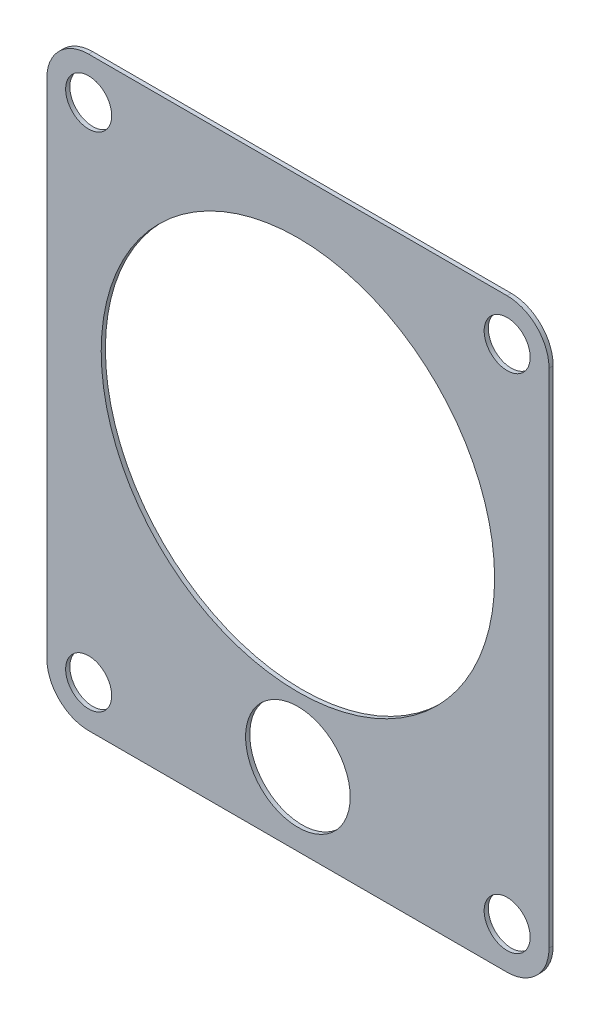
ISO-10303-21;
HEADER;
FILE_DESCRIPTION(('STEP AP214'),'2;1');
FILE_NAME('part.step','',(''),(''),'','','');
FILE_SCHEMA(('AUTOMOTIVE_DESIGN { 1 0 10303 214 1 1 1 1 }'));
ENDSEC;
DATA;
#1=APPLICATION_CONTEXT('core data for automotive mechanical design processes');
#2=APPLICATION_PROTOCOL_DEFINITION('international standard','automotive_design',2000,#1);
#3=PRODUCT_CONTEXT('',#1,'mechanical');
#4=PRODUCT('Part','Part','',(#3));
#5=PRODUCT_RELATED_PRODUCT_CATEGORY('part','',(#4));
#6=PRODUCT_DEFINITION_FORMATION('','',#4);
#7=PRODUCT_DEFINITION_CONTEXT('part definition',#1,'design');
#8=PRODUCT_DEFINITION('design','',#6,#7);
#9=PRODUCT_DEFINITION_SHAPE('','',#8);
#10=(LENGTH_UNIT() NAMED_UNIT(*) SI_UNIT(.MILLI.,.METRE.));
#11=(NAMED_UNIT(*) PLANE_ANGLE_UNIT() SI_UNIT($,.RADIAN.));
#12=(NAMED_UNIT(*) SI_UNIT($,.STERADIAN.) SOLID_ANGLE_UNIT());
#13=UNCERTAINTY_MEASURE_WITH_UNIT(LENGTH_MEASURE(1.E-05),#10,'distance_accuracy_value','');
#14=(GEOMETRIC_REPRESENTATION_CONTEXT(3) GLOBAL_UNCERTAINTY_ASSIGNED_CONTEXT((#13)) GLOBAL_UNIT_ASSIGNED_CONTEXT((#10,
#11,#12)) REPRESENTATION_CONTEXT('',''));
#15=CARTESIAN_POINT('',(0.,0.,0.));
#16=DIRECTION('',(0.,0.,1.));
#17=DIRECTION('',(1.,0.,0.));
#18=AXIS2_PLACEMENT_3D('',#15,#16,#17);
#19=CARTESIAN_POINT('',(10.,130.,1.));
#20=DIRECTION('',(0.,0.,1.));
#21=DIRECTION('',(1.,0.,0.));
#22=AXIS2_PLACEMENT_3D('',#19,#20,#21);
#23=PLANE('',#22);
#24=CARTESIAN_POINT('',(10.,10.,1.));
#25=DIRECTION('',(0.,0.,1.));
#26=DIRECTION('',(1.,0.,0.));
#27=AXIS2_PLACEMENT_3D('',#24,#25,#26);
#28=CIRCLE('',#27,5.5);
#29=CARTESIAN_POINT('',(15.5,10.,1.));
#30=VERTEX_POINT('',#29);
#31=EDGE_CURVE('E234',#30,#30,#28,.T.);
#32=ORIENTED_EDGE('',*,*,#31,.F.);
#33=EDGE_LOOP('',(#32));
#34=FACE_BOUND('',#33,.T.);
#35=CARTESIAN_POINT('',(10.,130.,1.));
#36=DIRECTION('',(0.,0.,1.));
#37=DIRECTION('',(1.,0.,0.));
#38=AXIS2_PLACEMENT_3D('',#35,#36,#37);
#39=CIRCLE('',#38,5.5);
#40=CARTESIAN_POINT('',(15.5,130.,1.));
#41=VERTEX_POINT('',#40);
#42=EDGE_CURVE('E246',#41,#41,#39,.T.);
#43=ORIENTED_EDGE('',*,*,#42,.F.);
#44=EDGE_LOOP('',(#43));
#45=FACE_BOUND('',#44,.T.);
#46=CARTESIAN_POINT('',(60.,80.,1.));
#47=DIRECTION('',(0.,0.,1.));
#48=DIRECTION('',(1.,0.,0.));
#49=AXIS2_PLACEMENT_3D('',#46,#47,#48);
#50=CIRCLE('',#49,47.);
#51=CARTESIAN_POINT('',(107.,80.,1.));
#52=VERTEX_POINT('',#51);
#53=EDGE_CURVE('E108',#52,#52,#50,.T.);
#54=ORIENTED_EDGE('',*,*,#53,.F.);
#55=EDGE_LOOP('',(#54));
#56=FACE_BOUND('',#55,.T.);
#57=CARTESIAN_POINT('',(10.,130.,1.));
#58=DIRECTION('',(0.,0.,1.));
#59=DIRECTION('',(1.,0.,0.));
#60=AXIS2_PLACEMENT_3D('',#57,#58,#59);
#61=CIRCLE('',#60,10.);
#62=CARTESIAN_POINT('',(10.0000000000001,140.,1.));
#63=VERTEX_POINT('',#62);
#64=CARTESIAN_POINT('',(0.,130.,1.));
#65=VERTEX_POINT('',#64);
#66=EDGE_CURVE('E126',#63,#65,#61,.T.);
#67=ORIENTED_EDGE('',*,*,#66,.T.);
#68=DIRECTION('',(0.,-1.,0.));
#69=VECTOR('',#68,1.);
#70=CARTESIAN_POINT('',(0.,10.0000000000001,1.));
#71=LINE('',#70,#69);
#72=CARTESIAN_POINT('',(0.,10.0000000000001,1.));
#73=VERTEX_POINT('',#72);
#74=EDGE_CURVE('E103',#65,#73,#71,.T.);
#75=ORIENTED_EDGE('',*,*,#74,.T.);
#76=CARTESIAN_POINT('',(10.,10.,1.));
#77=DIRECTION('',(0.,0.,1.));
#78=DIRECTION('',(1.,0.,0.));
#79=AXIS2_PLACEMENT_3D('',#76,#77,#78);
#80=CIRCLE('',#79,10.);
#81=CARTESIAN_POINT('',(10.0000000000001,0.,1.));
#82=VERTEX_POINT('',#81);
#83=EDGE_CURVE('E129',#73,#82,#80,.T.);
#84=ORIENTED_EDGE('',*,*,#83,.T.);
#85=DIRECTION('',(1.,0.,0.));
#86=VECTOR('',#85,1.);
#87=CARTESIAN_POINT('',(10.0000000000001,0.,1.));
#88=LINE('',#87,#86);
#89=CARTESIAN_POINT('',(110.,0.,1.));
#90=VERTEX_POINT('',#89);
#91=EDGE_CURVE('E131',#82,#90,#88,.T.);
#92=ORIENTED_EDGE('',*,*,#91,.T.);
#93=CARTESIAN_POINT('',(110.,10.,1.));
#94=DIRECTION('',(0.,0.,1.));
#95=DIRECTION('',(-1.,0.,0.));
#96=AXIS2_PLACEMENT_3D('',#93,#94,#95);
#97=CIRCLE('',#96,10.);
#98=CARTESIAN_POINT('',(120.,10.0000000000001,1.));
#99=VERTEX_POINT('',#98);
#100=EDGE_CURVE('E133',#90,#99,#97,.T.);
#101=ORIENTED_EDGE('',*,*,#100,.T.);
#102=DIRECTION('',(0.,1.,0.));
#103=VECTOR('',#102,1.);
#104=CARTESIAN_POINT('',(120.,10.0000000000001,1.));
#105=LINE('',#104,#103);
#106=CARTESIAN_POINT('',(120.,130.,1.));
#107=VERTEX_POINT('',#106);
#108=EDGE_CURVE('E135',#99,#107,#105,.T.);
#109=ORIENTED_EDGE('',*,*,#108,.T.);
#110=CARTESIAN_POINT('',(110.,130.,1.));
#111=DIRECTION('',(0.,0.,1.));
#112=DIRECTION('',(1.,0.,0.));
#113=AXIS2_PLACEMENT_3D('',#110,#111,#112);
#114=CIRCLE('',#113,10.);
#115=CARTESIAN_POINT('',(110.,140.,1.));
#116=VERTEX_POINT('',#115);
#117=EDGE_CURVE('E44',#107,#116,#114,.T.);
#118=ORIENTED_EDGE('',*,*,#117,.T.);
#119=DIRECTION('',(-1.,0.,0.));
#120=VECTOR('',#119,1.);
#121=CARTESIAN_POINT('',(10.0000000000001,140.,1.));
#122=LINE('',#121,#120);
#123=EDGE_CURVE('E39',#116,#63,#122,.T.);
#124=ORIENTED_EDGE('',*,*,#123,.T.);
#125=EDGE_LOOP('',(#67,#75,#84,#92,#101,#109,#118,#124));
#126=FACE_BOUND('',#125,.T.);
#127=CARTESIAN_POINT('',(60.,17.5,1.));
#128=DIRECTION('',(0.,0.,1.));
#129=DIRECTION('',(1.,0.,0.));
#130=AXIS2_PLACEMENT_3D('',#127,#128,#129);
#131=CIRCLE('',#130,12.5);
#132=CARTESIAN_POINT('',(72.5,17.5,1.));
#133=VERTEX_POINT('',#132);
#134=EDGE_CURVE('E252',#133,#133,#131,.T.);
#135=ORIENTED_EDGE('',*,*,#134,.F.);
#136=EDGE_LOOP('',(#135));
#137=FACE_BOUND('',#136,.T.);
#138=CARTESIAN_POINT('',(110.,130.,1.));
#139=DIRECTION('',(0.,0.,1.));
#140=DIRECTION('',(1.,0.,0.));
#141=AXIS2_PLACEMENT_3D('',#138,#139,#140);
#142=CIRCLE('',#141,5.5);
#143=CARTESIAN_POINT('',(115.5,130.,1.));
#144=VERTEX_POINT('',#143);
#145=EDGE_CURVE('E240',#144,#144,#142,.T.);
#146=ORIENTED_EDGE('',*,*,#145,.F.);
#147=EDGE_LOOP('',(#146));
#148=FACE_BOUND('',#147,.T.);
#149=CARTESIAN_POINT('',(110.,10.,1.));
#150=DIRECTION('',(0.,0.,1.));
#151=DIRECTION('',(1.,0.,0.));
#152=AXIS2_PLACEMENT_3D('',#149,#150,#151);
#153=CIRCLE('',#152,5.5);
#154=CARTESIAN_POINT('',(115.5,10.,1.));
#155=VERTEX_POINT('',#154);
#156=EDGE_CURVE('E223',#155,#155,#153,.T.);
#157=ORIENTED_EDGE('',*,*,#156,.F.);
#158=EDGE_LOOP('',(#157));
#159=FACE_BOUND('',#158,.T.);
#160=ADVANCED_FACE('F24',(#34,#45,#56,#126,#137,#148,#159),#23,.T.);
#161=CARTESIAN_POINT('',(10.,130.,0.));
#162=DIRECTION('',(0.,0.,1.));
#163=DIRECTION('',(1.,0.,0.));
#164=AXIS2_PLACEMENT_3D('',#161,#162,#163);
#165=PLANE('',#164);
#166=CARTESIAN_POINT('',(10.,10.,0.));
#167=DIRECTION('',(0.,0.,1.));
#168=DIRECTION('',(1.,0.,0.));
#169=AXIS2_PLACEMENT_3D('',#166,#167,#168);
#170=CIRCLE('',#169,5.5);
#171=CARTESIAN_POINT('',(15.5,10.,0.));
#172=VERTEX_POINT('',#171);
#173=EDGE_CURVE('E229',#172,#172,#170,.T.);
#174=ORIENTED_EDGE('',*,*,#173,.T.);
#175=EDGE_LOOP('',(#174));
#176=FACE_BOUND('',#175,.T.);
#177=CARTESIAN_POINT('',(10.,130.,0.));
#178=DIRECTION('',(0.,0.,1.));
#179=DIRECTION('',(1.,0.,0.));
#180=AXIS2_PLACEMENT_3D('',#177,#178,#179);
#181=CIRCLE('',#180,5.5);
#182=CARTESIAN_POINT('',(15.5,130.,0.));
#183=VERTEX_POINT('',#182);
#184=EDGE_CURVE('E243',#183,#183,#181,.T.);
#185=ORIENTED_EDGE('',*,*,#184,.T.);
#186=EDGE_LOOP('',(#185));
#187=FACE_BOUND('',#186,.T.);
#188=CARTESIAN_POINT('',(60.,80.,0.));
#189=DIRECTION('',(0.,0.,1.));
#190=DIRECTION('',(1.,0.,0.));
#191=AXIS2_PLACEMENT_3D('',#188,#189,#190);
#192=CIRCLE('',#191,47.);
#193=CARTESIAN_POINT('',(107.,80.,0.));
#194=VERTEX_POINT('',#193);
#195=EDGE_CURVE('E111',#194,#194,#192,.T.);
#196=ORIENTED_EDGE('',*,*,#195,.T.);
#197=EDGE_LOOP('',(#196));
#198=FACE_BOUND('',#197,.T.);
#199=CARTESIAN_POINT('',(10.,130.,0.));
#200=DIRECTION('',(0.,0.,1.));
#201=DIRECTION('',(1.,0.,0.));
#202=AXIS2_PLACEMENT_3D('',#199,#200,#201);
#203=CIRCLE('',#202,10.);
#204=CARTESIAN_POINT('',(10.0000000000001,140.,0.));
#205=VERTEX_POINT('',#204);
#206=CARTESIAN_POINT('',(0.,130.,0.));
#207=VERTEX_POINT('',#206);
#208=EDGE_CURVE('E94',#205,#207,#203,.T.);
#209=ORIENTED_EDGE('',*,*,#208,.F.);
#210=DIRECTION('',(-1.,0.,0.));
#211=VECTOR('',#210,1.);
#212=CARTESIAN_POINT('',(10.0000000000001,140.,0.));
#213=LINE('',#212,#211);
#214=CARTESIAN_POINT('',(110.,140.,0.));
#215=VERTEX_POINT('',#214);
#216=EDGE_CURVE('E124',#215,#205,#213,.T.);
#217=ORIENTED_EDGE('',*,*,#216,.F.);
#218=CARTESIAN_POINT('',(110.,130.,0.));
#219=DIRECTION('',(0.,0.,1.));
#220=DIRECTION('',(1.,0.,0.));
#221=AXIS2_PLACEMENT_3D('',#218,#219,#220);
#222=CIRCLE('',#221,10.);
#223=CARTESIAN_POINT('',(120.,130.,0.));
#224=VERTEX_POINT('',#223);
#225=EDGE_CURVE('E122',#224,#215,#222,.T.);
#226=ORIENTED_EDGE('',*,*,#225,.F.);
#227=DIRECTION('',(0.,1.,0.));
#228=VECTOR('',#227,1.);
#229=CARTESIAN_POINT('',(120.,10.0000000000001,0.));
#230=LINE('',#229,#228);
#231=CARTESIAN_POINT('',(120.,10.0000000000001,0.));
#232=VERTEX_POINT('',#231);
#233=EDGE_CURVE('E120',#232,#224,#230,.T.);
#234=ORIENTED_EDGE('',*,*,#233,.F.);
#235=CARTESIAN_POINT('',(110.,10.,0.));
#236=DIRECTION('',(0.,0.,1.));
#237=DIRECTION('',(-1.,0.,0.));
#238=AXIS2_PLACEMENT_3D('',#235,#236,#237);
#239=CIRCLE('',#238,10.);
#240=CARTESIAN_POINT('',(110.,0.,0.));
#241=VERTEX_POINT('',#240);
#242=EDGE_CURVE('E118',#241,#232,#239,.T.);
#243=ORIENTED_EDGE('',*,*,#242,.F.);
#244=DIRECTION('',(1.,0.,0.));
#245=VECTOR('',#244,1.);
#246=CARTESIAN_POINT('',(10.0000000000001,0.,0.));
#247=LINE('',#246,#245);
#248=CARTESIAN_POINT('',(10.0000000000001,0.,0.));
#249=VERTEX_POINT('',#248);
#250=EDGE_CURVE('E116',#249,#241,#247,.T.);
#251=ORIENTED_EDGE('',*,*,#250,.F.);
#252=CARTESIAN_POINT('',(10.,10.,0.));
#253=DIRECTION('',(0.,0.,1.));
#254=DIRECTION('',(1.,0.,0.));
#255=AXIS2_PLACEMENT_3D('',#252,#253,#254);
#256=CIRCLE('',#255,10.);
#257=CARTESIAN_POINT('',(0.,10.0000000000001,0.));
#258=VERTEX_POINT('',#257);
#259=EDGE_CURVE('E96',#258,#249,#256,.T.);
#260=ORIENTED_EDGE('',*,*,#259,.F.);
#261=DIRECTION('',(0.,-1.,0.));
#262=VECTOR('',#261,1.);
#263=CARTESIAN_POINT('',(0.,10.0000000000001,0.));
#264=LINE('',#263,#262);
#265=EDGE_CURVE('E89',#207,#258,#264,.T.);
#266=ORIENTED_EDGE('',*,*,#265,.F.);
#267=EDGE_LOOP('',(#209,#217,#226,#234,#243,#251,#260,#266));
#268=FACE_BOUND('',#267,.T.);
#269=CARTESIAN_POINT('',(60.,17.5,0.));
#270=DIRECTION('',(0.,0.,1.));
#271=DIRECTION('',(1.,0.,0.));
#272=AXIS2_PLACEMENT_3D('',#269,#270,#271);
#273=CIRCLE('',#272,12.5);
#274=CARTESIAN_POINT('',(72.5,17.5,0.));
#275=VERTEX_POINT('',#274);
#276=EDGE_CURVE('E249',#275,#275,#273,.T.);
#277=ORIENTED_EDGE('',*,*,#276,.T.);
#278=EDGE_LOOP('',(#277));
#279=FACE_BOUND('',#278,.T.);
#280=CARTESIAN_POINT('',(110.,130.,0.));
#281=DIRECTION('',(0.,0.,1.));
#282=DIRECTION('',(1.,0.,0.));
#283=AXIS2_PLACEMENT_3D('',#280,#281,#282);
#284=CIRCLE('',#283,5.5);
#285=CARTESIAN_POINT('',(115.5,130.,0.));
#286=VERTEX_POINT('',#285);
#287=EDGE_CURVE('E237',#286,#286,#284,.T.);
#288=ORIENTED_EDGE('',*,*,#287,.T.);
#289=EDGE_LOOP('',(#288));
#290=FACE_BOUND('',#289,.T.);
#291=CARTESIAN_POINT('',(110.,10.,0.));
#292=DIRECTION('',(0.,0.,1.));
#293=DIRECTION('',(1.,0.,0.));
#294=AXIS2_PLACEMENT_3D('',#291,#292,#293);
#295=CIRCLE('',#294,5.5);
#296=CARTESIAN_POINT('',(115.5,10.,0.));
#297=VERTEX_POINT('',#296);
#298=EDGE_CURVE('E226',#297,#297,#295,.T.);
#299=ORIENTED_EDGE('',*,*,#298,.T.);
#300=EDGE_LOOP('',(#299));
#301=FACE_BOUND('',#300,.T.);
#302=ADVANCED_FACE('F90',(#176,#187,#198,#268,#279,#290,#301),#165,.F.);
#303=CARTESIAN_POINT('',(10.,130.,1.));
#304=DIRECTION('',(0.,0.,-1.));
#305=DIRECTION('',(-1.,0.,0.));
#306=AXIS2_PLACEMENT_3D('',#303,#304,#305);
#307=CYLINDRICAL_SURFACE('',#306,10.);
#308=ORIENTED_EDGE('',*,*,#208,.T.);
#309=DIRECTION('',(0.,0.,-1.));
#310=VECTOR('',#309,1.);
#311=CARTESIAN_POINT('',(0.,130.,1.));
#312=LINE('',#311,#310);
#313=EDGE_CURVE('E11',#65,#207,#312,.T.);
#314=ORIENTED_EDGE('',*,*,#313,.F.);
#315=ORIENTED_EDGE('',*,*,#66,.F.);
#316=DIRECTION('',(0.,0.,-1.));
#317=VECTOR('',#316,1.);
#318=CARTESIAN_POINT('',(10.0000000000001,140.,1.));
#319=LINE('',#318,#317);
#320=EDGE_CURVE('E107',#63,#205,#319,.T.);
#321=ORIENTED_EDGE('',*,*,#320,.T.);
#322=EDGE_LOOP('',(#308,#314,#315,#321));
#323=FACE_BOUND('',#322,.T.);
#324=ADVANCED_FACE('F26',(#323),#307,.T.);
#325=CARTESIAN_POINT('',(0.,10.0000000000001,1.));
#326=DIRECTION('',(1.,0.,0.));
#327=DIRECTION('',(0.,0.,-1.));
#328=AXIS2_PLACEMENT_3D('',#325,#326,#327);
#329=PLANE('',#328);
#330=ORIENTED_EDGE('',*,*,#265,.T.);
#331=DIRECTION('',(0.,0.,-1.));
#332=VECTOR('',#331,1.);
#333=CARTESIAN_POINT('',(0.,10.0000000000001,1.));
#334=LINE('',#333,#332);
#335=EDGE_CURVE('E32',#73,#258,#334,.T.);
#336=ORIENTED_EDGE('',*,*,#335,.F.);
#337=ORIENTED_EDGE('',*,*,#74,.F.);
#338=ORIENTED_EDGE('',*,*,#313,.T.);
#339=EDGE_LOOP('',(#330,#336,#337,#338));
#340=FACE_BOUND('',#339,.T.);
#341=ADVANCED_FACE('F102',(#340),#329,.F.);
#342=CARTESIAN_POINT('',(10.,10.,1.));
#343=DIRECTION('',(0.,0.,-1.));
#344=DIRECTION('',(-1.,0.,0.));
#345=AXIS2_PLACEMENT_3D('',#342,#343,#344);
#346=CYLINDRICAL_SURFACE('',#345,10.);
#347=ORIENTED_EDGE('',*,*,#259,.T.);
#348=DIRECTION('',(0.,0.,-1.));
#349=VECTOR('',#348,1.);
#350=CARTESIAN_POINT('',(10.0000000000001,0.,1.));
#351=LINE('',#350,#349);
#352=EDGE_CURVE('E152',#82,#249,#351,.T.);
#353=ORIENTED_EDGE('',*,*,#352,.F.);
#354=ORIENTED_EDGE('',*,*,#83,.F.);
#355=ORIENTED_EDGE('',*,*,#335,.T.);
#356=EDGE_LOOP('',(#347,#353,#354,#355));
#357=FACE_BOUND('',#356,.T.);
#358=ADVANCED_FACE('F156',(#357),#346,.T.);
#359=CARTESIAN_POINT('',(10.0000000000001,0.,1.));
#360=DIRECTION('',(0.,1.,0.));
#361=DIRECTION('',(0.,0.,1.));
#362=AXIS2_PLACEMENT_3D('',#359,#360,#361);
#363=PLANE('',#362);
#364=ORIENTED_EDGE('',*,*,#250,.T.);
#365=DIRECTION('',(0.,0.,-1.));
#366=VECTOR('',#365,1.);
#367=CARTESIAN_POINT('',(110.,0.,1.));
#368=LINE('',#367,#366);
#369=EDGE_CURVE('E149',#90,#241,#368,.T.);
#370=ORIENTED_EDGE('',*,*,#369,.F.);
#371=ORIENTED_EDGE('',*,*,#91,.F.);
#372=ORIENTED_EDGE('',*,*,#352,.T.);
#373=EDGE_LOOP('',(#364,#370,#371,#372));
#374=FACE_BOUND('',#373,.T.);
#375=ADVANCED_FACE('F164',(#374),#363,.F.);
#376=CARTESIAN_POINT('',(110.,10.,1.));
#377=DIRECTION('',(0.,0.,-1.));
#378=DIRECTION('',(-1.,0.,0.));
#379=AXIS2_PLACEMENT_3D('',#376,#377,#378);
#380=CYLINDRICAL_SURFACE('',#379,10.);
#381=ORIENTED_EDGE('',*,*,#242,.T.);
#382=DIRECTION('',(0.,0.,-1.));
#383=VECTOR('',#382,1.);
#384=CARTESIAN_POINT('',(120.,10.0000000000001,1.));
#385=LINE('',#384,#383);
#386=EDGE_CURVE('E146',#99,#232,#385,.T.);
#387=ORIENTED_EDGE('',*,*,#386,.F.);
#388=ORIENTED_EDGE('',*,*,#100,.F.);
#389=ORIENTED_EDGE('',*,*,#369,.T.);
#390=EDGE_LOOP('',(#381,#387,#388,#389));
#391=FACE_BOUND('',#390,.T.);
#392=ADVANCED_FACE('F167',(#391),#380,.T.);
#393=CARTESIAN_POINT('',(120.,10.0000000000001,1.));
#394=DIRECTION('',(-1.,0.,0.));
#395=DIRECTION('',(0.,0.,1.));
#396=AXIS2_PLACEMENT_3D('',#393,#394,#395);
#397=PLANE('',#396);
#398=ORIENTED_EDGE('',*,*,#233,.T.);
#399=DIRECTION('',(0.,0.,-1.));
#400=VECTOR('',#399,1.);
#401=CARTESIAN_POINT('',(120.,130.,1.));
#402=LINE('',#401,#400);
#403=EDGE_CURVE('E143',#107,#224,#402,.T.);
#404=ORIENTED_EDGE('',*,*,#403,.F.);
#405=ORIENTED_EDGE('',*,*,#108,.F.);
#406=ORIENTED_EDGE('',*,*,#386,.T.);
#407=EDGE_LOOP('',(#398,#404,#405,#406));
#408=FACE_BOUND('',#407,.T.);
#409=ADVANCED_FACE('F172',(#408),#397,.F.);
#410=CARTESIAN_POINT('',(110.,130.,1.));
#411=DIRECTION('',(0.,0.,-1.));
#412=DIRECTION('',(-1.,0.,0.));
#413=AXIS2_PLACEMENT_3D('',#410,#411,#412);
#414=CYLINDRICAL_SURFACE('',#413,10.);
#415=ORIENTED_EDGE('',*,*,#225,.T.);
#416=DIRECTION('',(0.,0.,-1.));
#417=VECTOR('',#416,1.);
#418=CARTESIAN_POINT('',(110.,140.,1.));
#419=LINE('',#418,#417);
#420=EDGE_CURVE('E140',#116,#215,#419,.T.);
#421=ORIENTED_EDGE('',*,*,#420,.F.);
#422=ORIENTED_EDGE('',*,*,#117,.F.);
#423=ORIENTED_EDGE('',*,*,#403,.T.);
#424=EDGE_LOOP('',(#415,#421,#422,#423));
#425=FACE_BOUND('',#424,.T.);
#426=ADVANCED_FACE('F175',(#425),#414,.T.);
#427=CARTESIAN_POINT('',(10.0000000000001,140.,1.));
#428=DIRECTION('',(0.,-1.,0.));
#429=DIRECTION('',(0.,0.,-1.));
#430=AXIS2_PLACEMENT_3D('',#427,#428,#429);
#431=PLANE('',#430);
#432=ORIENTED_EDGE('',*,*,#216,.T.);
#433=ORIENTED_EDGE('',*,*,#320,.F.);
#434=ORIENTED_EDGE('',*,*,#123,.F.);
#435=ORIENTED_EDGE('',*,*,#420,.T.);
#436=EDGE_LOOP('',(#432,#433,#434,#435));
#437=FACE_BOUND('',#436,.T.);
#438=ADVANCED_FACE('F177',(#437),#431,.F.);
#439=CARTESIAN_POINT('',(60.,80.,1.));
#440=DIRECTION('',(0.,0.,-1.));
#441=DIRECTION('',(-1.,0.,0.));
#442=AXIS2_PLACEMENT_3D('',#439,#440,#441);
#443=CYLINDRICAL_SURFACE('',#442,47.);
#444=ORIENTED_EDGE('',*,*,#53,.T.);
#445=EDGE_LOOP('',(#444));
#446=FACE_BOUND('',#445,.T.);
#447=ORIENTED_EDGE('',*,*,#195,.F.);
#448=EDGE_LOOP('',(#447));
#449=FACE_BOUND('',#448,.T.);
#450=ADVANCED_FACE('F179',(#446,#449),#443,.F.);
#451=CARTESIAN_POINT('',(60.,17.5,1.));
#452=DIRECTION('',(0.,0.,-1.));
#453=DIRECTION('',(-1.,0.,0.));
#454=AXIS2_PLACEMENT_3D('',#451,#452,#453);
#455=CYLINDRICAL_SURFACE('',#454,12.5);
#456=ORIENTED_EDGE('',*,*,#134,.T.);
#457=EDGE_LOOP('',(#456));
#458=FACE_BOUND('',#457,.T.);
#459=ORIENTED_EDGE('',*,*,#276,.F.);
#460=EDGE_LOOP('',(#459));
#461=FACE_BOUND('',#460,.T.);
#462=ADVANCED_FACE('F185',(#458,#461),#455,.F.);
#463=CARTESIAN_POINT('',(10.,130.,1.));
#464=DIRECTION('',(0.,0.,-1.));
#465=DIRECTION('',(-1.,0.,0.));
#466=AXIS2_PLACEMENT_3D('',#463,#464,#465);
#467=CYLINDRICAL_SURFACE('',#466,5.5);
#468=ORIENTED_EDGE('',*,*,#42,.T.);
#469=EDGE_LOOP('',(#468));
#470=FACE_BOUND('',#469,.T.);
#471=ORIENTED_EDGE('',*,*,#184,.F.);
#472=EDGE_LOOP('',(#471));
#473=FACE_BOUND('',#472,.T.);
#474=ADVANCED_FACE('F202',(#470,#473),#467,.F.);
#475=CARTESIAN_POINT('',(110.,130.,1.));
#476=DIRECTION('',(0.,0.,-1.));
#477=DIRECTION('',(-1.,0.,0.));
#478=AXIS2_PLACEMENT_3D('',#475,#476,#477);
#479=CYLINDRICAL_SURFACE('',#478,5.5);
#480=ORIENTED_EDGE('',*,*,#145,.T.);
#481=EDGE_LOOP('',(#480));
#482=FACE_BOUND('',#481,.T.);
#483=ORIENTED_EDGE('',*,*,#287,.F.);
#484=EDGE_LOOP('',(#483));
#485=FACE_BOUND('',#484,.T.);
#486=ADVANCED_FACE('F206',(#482,#485),#479,.F.);
#487=CARTESIAN_POINT('',(10.,10.,1.));
#488=DIRECTION('',(0.,0.,-1.));
#489=DIRECTION('',(-1.,0.,0.));
#490=AXIS2_PLACEMENT_3D('',#487,#488,#489);
#491=CYLINDRICAL_SURFACE('',#490,5.5);
#492=ORIENTED_EDGE('',*,*,#31,.T.);
#493=EDGE_LOOP('',(#492));
#494=FACE_BOUND('',#493,.T.);
#495=ORIENTED_EDGE('',*,*,#173,.F.);
#496=EDGE_LOOP('',(#495));
#497=FACE_BOUND('',#496,.T.);
#498=ADVANCED_FACE('F210',(#494,#497),#491,.F.);
#499=CARTESIAN_POINT('',(110.,10.,1.));
#500=DIRECTION('',(0.,0.,-1.));
#501=DIRECTION('',(-1.,0.,0.));
#502=AXIS2_PLACEMENT_3D('',#499,#500,#501);
#503=CYLINDRICAL_SURFACE('',#502,5.5);
#504=ORIENTED_EDGE('',*,*,#156,.T.);
#505=EDGE_LOOP('',(#504));
#506=FACE_BOUND('',#505,.T.);
#507=ORIENTED_EDGE('',*,*,#298,.F.);
#508=EDGE_LOOP('',(#507));
#509=FACE_BOUND('',#508,.T.);
#510=ADVANCED_FACE('F214',(#506,#509),#503,.F.);
#511=CLOSED_SHELL('',(#160,#302,#324,#341,#358,#375,#392,#409,#426,#438,#450,#462,#474,#486,
#498,#510));
#512=MANIFOLD_SOLID_BREP('B2',#511);
#513=ADVANCED_BREP_SHAPE_REPRESENTATION('',(#18,#512),#14);
#514=SHAPE_DEFINITION_REPRESENTATION(#9,#513);
ENDSEC;
END-ISO-10303-21;
